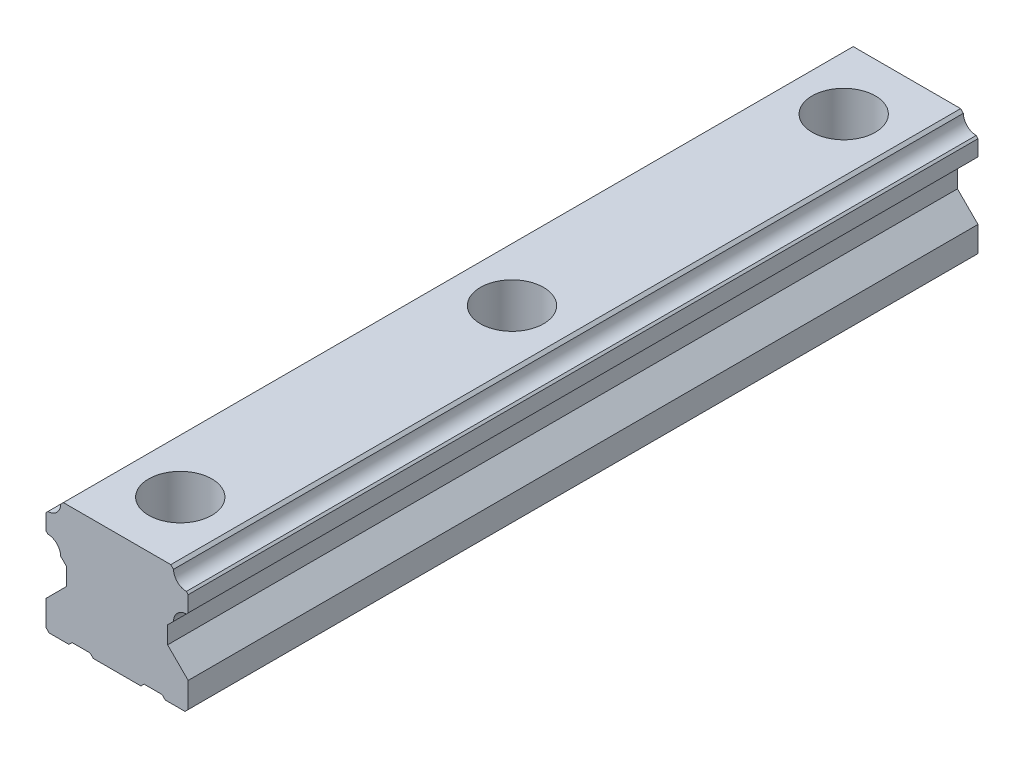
ISO-10303-21;
HEADER;
FILE_DESCRIPTION(('STEP AP214'),'2;1');
FILE_NAME('part.step','',(''),(''),'','','');
FILE_SCHEMA(('AUTOMOTIVE_DESIGN { 1 0 10303 214 1 1 1 1 }'));
ENDSEC;
DATA;
#1=APPLICATION_CONTEXT('core data for automotive mechanical design processes');
#2=APPLICATION_PROTOCOL_DEFINITION('international standard','automotive_design',2000,#1);
#3=PRODUCT_CONTEXT('',#1,'mechanical');
#4=PRODUCT('Part','Part','',(#3));
#5=PRODUCT_RELATED_PRODUCT_CATEGORY('part','',(#4));
#6=PRODUCT_DEFINITION_FORMATION('','',#4);
#7=PRODUCT_DEFINITION_CONTEXT('part definition',#1,'design');
#8=PRODUCT_DEFINITION('design','',#6,#7);
#9=PRODUCT_DEFINITION_SHAPE('','',#8);
#10=(LENGTH_UNIT() NAMED_UNIT(*) SI_UNIT(.MILLI.,.METRE.));
#11=(NAMED_UNIT(*) PLANE_ANGLE_UNIT() SI_UNIT($,.RADIAN.));
#12=(NAMED_UNIT(*) SI_UNIT($,.STERADIAN.) SOLID_ANGLE_UNIT());
#13=UNCERTAINTY_MEASURE_WITH_UNIT(LENGTH_MEASURE(1.E-05),#10,'distance_accuracy_value','');
#14=(GEOMETRIC_REPRESENTATION_CONTEXT(3) GLOBAL_UNCERTAINTY_ASSIGNED_CONTEXT((#13)) GLOBAL_UNIT_ASSIGNED_CONTEXT((#10,
#11,#12)) REPRESENTATION_CONTEXT('',''));
#15=CARTESIAN_POINT('',(0.,0.,0.));
#16=DIRECTION('',(0.,0.,1.));
#17=DIRECTION('',(1.,0.,0.));
#18=AXIS2_PLACEMENT_3D('',#15,#16,#17);
#19=CARTESIAN_POINT('',(-17.8608307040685,37.1391692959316,-250.));
#20=DIRECTION('',(0.707106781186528,-0.707106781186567,0.));
#21=DIRECTION('',(0.707106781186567,0.707106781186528,0.));
#22=AXIS2_PLACEMENT_3D('',#19,#20,#21);
#23=PLANE('',#22);
#24=DIRECTION('',(0.707106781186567,0.707106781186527,0.));
#25=VECTOR('',#24,1.);
#26=CARTESIAN_POINT('',(-17.8608307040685,37.1391692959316,0.));
#27=LINE('',#26,#25);
#28=CARTESIAN_POINT('',(-17.8608307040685,37.1391692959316,0.));
#29=VERTEX_POINT('',#28);
#30=CARTESIAN_POINT('',(-17.,38.,0.));
#31=VERTEX_POINT('',#30);
#32=EDGE_CURVE('E284',#29,#31,#27,.T.);
#33=ORIENTED_EDGE('',*,*,#32,.T.);
#34=DIRECTION('',(0.,0.,1.));
#35=VECTOR('',#34,1.);
#36=CARTESIAN_POINT('',(-17.,38.,-250.));
#37=LINE('',#36,#35);
#38=CARTESIAN_POINT('',(-17.,38.,-250.));
#39=VERTEX_POINT('',#38);
#40=EDGE_CURVE('E11',#39,#31,#37,.T.);
#41=ORIENTED_EDGE('',*,*,#40,.F.);
#42=DIRECTION('',(0.707106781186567,0.707106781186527,0.));
#43=VECTOR('',#42,1.);
#44=CARTESIAN_POINT('',(-17.8608307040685,37.1391692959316,-250.));
#45=LINE('',#44,#43);
#46=CARTESIAN_POINT('',(-17.8608307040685,37.1391692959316,-250.));
#47=VERTEX_POINT('',#46);
#48=EDGE_CURVE('E379',#47,#39,#45,.T.);
#49=ORIENTED_EDGE('',*,*,#48,.F.);
#50=DIRECTION('',(0.,0.,1.));
#51=VECTOR('',#50,1.);
#52=CARTESIAN_POINT('',(-17.8608307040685,37.1391692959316,-250.));
#53=LINE('',#52,#51);
#54=EDGE_CURVE('E280',#47,#29,#53,.T.);
#55=ORIENTED_EDGE('',*,*,#54,.T.);
#56=EDGE_LOOP('',(#33,#41,#49,#55));
#57=FACE_BOUND('',#56,.T.);
#58=ADVANCED_FACE('F39',(#57),#23,.F.);
#59=CARTESIAN_POINT('',(-17.,38.,-250.));
#60=DIRECTION('',(0.,-1.,0.));
#61=DIRECTION('',(0.,0.,-1.));
#62=AXIS2_PLACEMENT_3D('',#59,#60,#61);
#63=PLANE('',#62);
#64=CARTESIAN_POINT('',(0.,38.,-230.));
#65=DIRECTION('',(0.,1.,0.));
#66=DIRECTION('',(0.,0.,1.));
#67=AXIS2_PLACEMENT_3D('',#64,#65,#66);
#68=CIRCLE('',#67,10.);
#69=CARTESIAN_POINT('',(0.,38.,-220.));
#70=VERTEX_POINT('',#69);
#71=EDGE_CURVE('E860',#70,#70,#68,.T.);
#72=ORIENTED_EDGE('',*,*,#71,.F.);
#73=EDGE_LOOP('',(#72));
#74=FACE_BOUND('',#73,.T.);
#75=CARTESIAN_POINT('',(0.,38.,-125.));
#76=DIRECTION('',(0.,1.,0.));
#77=DIRECTION('',(0.,0.,1.));
#78=AXIS2_PLACEMENT_3D('',#75,#76,#77);
#79=CIRCLE('',#78,10.);
#80=CARTESIAN_POINT('',(0.,38.,-115.));
#81=VERTEX_POINT('',#80);
#82=EDGE_CURVE('E874',#81,#81,#79,.T.);
#83=ORIENTED_EDGE('',*,*,#82,.F.);
#84=EDGE_LOOP('',(#83));
#85=FACE_BOUND('',#84,.T.);
#86=CARTESIAN_POINT('',(0.,38.,-20.));
#87=DIRECTION('',(0.,1.,0.));
#88=DIRECTION('',(0.,0.,1.));
#89=AXIS2_PLACEMENT_3D('',#86,#87,#88);
#90=CIRCLE('',#89,10.);
#91=CARTESIAN_POINT('',(0.,38.,-10.));
#92=VERTEX_POINT('',#91);
#93=EDGE_CURVE('E890',#92,#92,#90,.T.);
#94=ORIENTED_EDGE('',*,*,#93,.F.);
#95=EDGE_LOOP('',(#94));
#96=FACE_BOUND('',#95,.T.);
#97=DIRECTION('',(1.,0.,0.));
#98=VECTOR('',#97,1.);
#99=CARTESIAN_POINT('',(-17.,38.,0.));
#100=LINE('',#99,#98);
#101=CARTESIAN_POINT('',(17.,38.,0.));
#102=VERTEX_POINT('',#101);
#103=EDGE_CURVE('E288',#31,#102,#100,.T.);
#104=ORIENTED_EDGE('',*,*,#103,.T.);
#105=DIRECTION('',(0.,0.,1.));
#106=VECTOR('',#105,1.);
#107=CARTESIAN_POINT('',(17.,38.,-250.));
#108=LINE('',#107,#106);
#109=CARTESIAN_POINT('',(17.,38.,-250.));
#110=VERTEX_POINT('',#109);
#111=EDGE_CURVE('E48',#110,#102,#108,.T.);
#112=ORIENTED_EDGE('',*,*,#111,.F.);
#113=DIRECTION('',(1.,0.,0.));
#114=VECTOR('',#113,1.);
#115=CARTESIAN_POINT('',(-17.,38.,-250.));
#116=LINE('',#115,#114);
#117=EDGE_CURVE('E171',#39,#110,#116,.T.);
#118=ORIENTED_EDGE('',*,*,#117,.F.);
#119=ORIENTED_EDGE('',*,*,#40,.T.);
#120=EDGE_LOOP('',(#104,#112,#118,#119));
#121=FACE_BOUND('',#120,.T.);
#122=ADVANCED_FACE('F613',(#74,#85,#96,#121),#63,.F.);
#123=CARTESIAN_POINT('',(17.,38.,-250.));
#124=DIRECTION('',(-0.707106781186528,-0.707106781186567,0.));
#125=DIRECTION('',(0.707106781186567,-0.707106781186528,0.));
#126=AXIS2_PLACEMENT_3D('',#123,#124,#125);
#127=PLANE('',#126);
#128=DIRECTION('',(0.707106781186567,-0.707106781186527,0.));
#129=VECTOR('',#128,1.);
#130=CARTESIAN_POINT('',(17.,38.,0.));
#131=LINE('',#130,#129);
#132=CARTESIAN_POINT('',(17.8608307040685,37.1391692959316,0.));
#133=VERTEX_POINT('',#132);
#134=EDGE_CURVE('E292',#102,#133,#131,.T.);
#135=ORIENTED_EDGE('',*,*,#134,.T.);
#136=DIRECTION('',(0.,0.,1.));
#137=VECTOR('',#136,1.);
#138=CARTESIAN_POINT('',(17.8608307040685,37.1391692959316,-250.));
#139=LINE('',#138,#137);
#140=CARTESIAN_POINT('',(17.8608307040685,37.1391692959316,-250.));
#141=VERTEX_POINT('',#140);
#142=EDGE_CURVE('E486',#141,#133,#139,.T.);
#143=ORIENTED_EDGE('',*,*,#142,.F.);
#144=DIRECTION('',(0.707106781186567,-0.707106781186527,0.));
#145=VECTOR('',#144,1.);
#146=CARTESIAN_POINT('',(17.,38.,-250.));
#147=LINE('',#146,#145);
#148=EDGE_CURVE('E496',#110,#141,#147,.T.);
#149=ORIENTED_EDGE('',*,*,#148,.F.);
#150=ORIENTED_EDGE('',*,*,#111,.T.);
#151=EDGE_LOOP('',(#135,#143,#149,#150));
#152=FACE_BOUND('',#151,.T.);
#153=ADVANCED_FACE('F494',(#152),#127,.F.);
#154=CARTESIAN_POINT('',(21.99,37.222,-250.));
#155=DIRECTION('',(0.,0.,1.));
#156=DIRECTION('',(1.,0.,0.));
#157=AXIS2_PLACEMENT_3D('',#154,#155,#156);
#158=CYLINDRICAL_SURFACE('',#157,4.12999999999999);
#159=CARTESIAN_POINT('',(21.99,37.222,0.));
#160=DIRECTION('',(0.,0.,1.));
#161=DIRECTION('',(1.,0.,0.));
#162=AXIS2_PLACEMENT_3D('',#159,#160,#161);
#163=CIRCLE('',#162,4.12999999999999);
#164=CARTESIAN_POINT('',(21.9071692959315,33.0928307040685,0.));
#165=VERTEX_POINT('',#164);
#166=EDGE_CURVE('E295',#133,#165,#163,.T.);
#167=ORIENTED_EDGE('',*,*,#166,.T.);
#168=DIRECTION('',(0.,0.,1.));
#169=VECTOR('',#168,1.);
#170=CARTESIAN_POINT('',(21.9071692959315,33.0928307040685,-250.));
#171=LINE('',#170,#169);
#172=CARTESIAN_POINT('',(21.9071692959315,33.0928307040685,-250.));
#173=VERTEX_POINT('',#172);
#174=EDGE_CURVE('E482',#173,#165,#171,.T.);
#175=ORIENTED_EDGE('',*,*,#174,.F.);
#176=CARTESIAN_POINT('',(21.99,37.222,-250.));
#177=DIRECTION('',(0.,0.,1.));
#178=DIRECTION('',(1.,0.,0.));
#179=AXIS2_PLACEMENT_3D('',#176,#177,#178);
#180=CIRCLE('',#179,4.12999999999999);
#181=EDGE_CURVE('E515',#141,#173,#180,.T.);
#182=ORIENTED_EDGE('',*,*,#181,.F.);
#183=ORIENTED_EDGE('',*,*,#142,.T.);
#184=EDGE_LOOP('',(#167,#175,#182,#183));
#185=FACE_BOUND('',#184,.T.);
#186=ADVANCED_FACE('F505',(#185),#158,.F.);
#187=CARTESIAN_POINT('',(21.9071692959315,33.0928307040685,-250.));
#188=DIRECTION('',(-0.707106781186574,-0.707106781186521,0.));
#189=DIRECTION('',(0.707106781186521,-0.707106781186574,0.));
#190=AXIS2_PLACEMENT_3D('',#187,#188,#189);
#191=PLANE('',#190);
#192=DIRECTION('',(0.707106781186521,-0.707106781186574,0.));
#193=VECTOR('',#192,1.);
#194=CARTESIAN_POINT('',(21.9071692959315,33.0928307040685,0.));
#195=LINE('',#194,#193);
#196=CARTESIAN_POINT('',(22.5,32.5,0.));
#197=VERTEX_POINT('',#196);
#198=EDGE_CURVE('E298',#165,#197,#195,.T.);
#199=ORIENTED_EDGE('',*,*,#198,.T.);
#200=DIRECTION('',(0.,0.,1.));
#201=VECTOR('',#200,1.);
#202=CARTESIAN_POINT('',(22.5,32.5,-250.));
#203=LINE('',#202,#201);
#204=CARTESIAN_POINT('',(22.5,32.5,-250.));
#205=VERTEX_POINT('',#204);
#206=EDGE_CURVE('E478',#205,#197,#203,.T.);
#207=ORIENTED_EDGE('',*,*,#206,.F.);
#208=DIRECTION('',(0.707106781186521,-0.707106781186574,0.));
#209=VECTOR('',#208,1.);
#210=CARTESIAN_POINT('',(21.9071692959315,33.0928307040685,-250.));
#211=LINE('',#210,#209);
#212=EDGE_CURVE('E511',#173,#205,#211,.T.);
#213=ORIENTED_EDGE('',*,*,#212,.F.);
#214=ORIENTED_EDGE('',*,*,#174,.T.);
#215=EDGE_LOOP('',(#199,#207,#213,#214));
#216=FACE_BOUND('',#215,.T.);
#217=ADVANCED_FACE('F509',(#216),#191,.F.);
#218=CARTESIAN_POINT('',(22.5,32.5,-250.));
#219=DIRECTION('',(-1.,0.,0.));
#220=DIRECTION('',(0.,0.,1.));
#221=AXIS2_PLACEMENT_3D('',#218,#219,#220);
#222=PLANE('',#221);
#223=DIRECTION('',(0.,-1.,0.));
#224=VECTOR('',#223,1.);
#225=CARTESIAN_POINT('',(22.5,32.5,0.));
#226=LINE('',#225,#224);
#227=CARTESIAN_POINT('',(22.5,27.5,0.));
#228=VERTEX_POINT('',#227);
#229=EDGE_CURVE('E301',#197,#228,#226,.T.);
#230=ORIENTED_EDGE('',*,*,#229,.T.);
#231=DIRECTION('',(0.,0.,1.));
#232=VECTOR('',#231,1.);
#233=CARTESIAN_POINT('',(22.5,27.5,-250.));
#234=LINE('',#233,#232);
#235=CARTESIAN_POINT('',(22.5,27.5,-250.));
#236=VERTEX_POINT('',#235);
#237=EDGE_CURVE('E474',#236,#228,#234,.T.);
#238=ORIENTED_EDGE('',*,*,#237,.F.);
#239=DIRECTION('',(0.,-1.,0.));
#240=VECTOR('',#239,1.);
#241=CARTESIAN_POINT('',(22.5,32.5,-250.));
#242=LINE('',#241,#240);
#243=EDGE_CURVE('E514',#205,#236,#242,.T.);
#244=ORIENTED_EDGE('',*,*,#243,.F.);
#245=ORIENTED_EDGE('',*,*,#206,.T.);
#246=EDGE_LOOP('',(#230,#238,#244,#245));
#247=FACE_BOUND('',#246,.T.);
#248=ADVANCED_FACE('F629',(#247),#222,.F.);
#249=CARTESIAN_POINT('',(22.5,27.5,-250.));
#250=DIRECTION('',(-0.707106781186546,0.70710678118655,0.));
#251=DIRECTION('',(-0.70710678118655,-0.707106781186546,0.));
#252=AXIS2_PLACEMENT_3D('',#249,#250,#251);
#253=PLANE('',#252);
#254=DIRECTION('',(-0.70710678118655,-0.707106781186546,0.));
#255=VECTOR('',#254,1.);
#256=CARTESIAN_POINT('',(22.5,27.5,0.));
#257=LINE('',#256,#255);
#258=CARTESIAN_POINT('',(21.9092097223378,26.9092097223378,0.));
#259=VERTEX_POINT('',#258);
#260=EDGE_CURVE('E304',#228,#259,#257,.T.);
#261=ORIENTED_EDGE('',*,*,#260,.T.);
#262=DIRECTION('',(0.,0.,1.));
#263=VECTOR('',#262,1.);
#264=CARTESIAN_POINT('',(21.9092097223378,26.9092097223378,-250.));
#265=LINE('',#264,#263);
#266=CARTESIAN_POINT('',(21.9092097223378,26.9092097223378,-250.));
#267=VERTEX_POINT('',#266);
#268=EDGE_CURVE('E470',#267,#259,#265,.T.);
#269=ORIENTED_EDGE('',*,*,#268,.F.);
#270=DIRECTION('',(-0.70710678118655,-0.707106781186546,0.));
#271=VECTOR('',#270,1.);
#272=CARTESIAN_POINT('',(22.5,27.5,-250.));
#273=LINE('',#272,#271);
#274=EDGE_CURVE('E519',#236,#267,#273,.T.);
#275=ORIENTED_EDGE('',*,*,#274,.F.);
#276=ORIENTED_EDGE('',*,*,#237,.T.);
#277=EDGE_LOOP('',(#261,#269,#275,#276));
#278=FACE_BOUND('',#277,.T.);
#279=ADVANCED_FACE('F632',(#278),#253,.F.);
#280=CARTESIAN_POINT('',(21.9899999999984,22.7800000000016,-250.));
#281=DIRECTION('',(0.,0.,1.));
#282=DIRECTION('',(1.,0.,0.));
#283=AXIS2_PLACEMENT_3D('',#280,#281,#282);
#284=CYLINDRICAL_SURFACE('',#283,4.13);
#285=CARTESIAN_POINT('',(21.9899999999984,22.7800000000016,0.));
#286=DIRECTION('',(0.,0.,1.));
#287=DIRECTION('',(1.,0.,0.));
#288=AXIS2_PLACEMENT_3D('',#285,#286,#287);
#289=CIRCLE('',#288,4.13);
#290=CARTESIAN_POINT('',(17.8607902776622,22.8607902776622,0.));
#291=VERTEX_POINT('',#290);
#292=EDGE_CURVE('E307',#259,#291,#289,.T.);
#293=ORIENTED_EDGE('',*,*,#292,.T.);
#294=DIRECTION('',(0.,0.,1.));
#295=VECTOR('',#294,1.);
#296=CARTESIAN_POINT('',(17.8607902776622,22.8607902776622,-250.));
#297=LINE('',#296,#295);
#298=CARTESIAN_POINT('',(17.8607902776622,22.8607902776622,-250.));
#299=VERTEX_POINT('',#298);
#300=EDGE_CURVE('E466',#299,#291,#297,.T.);
#301=ORIENTED_EDGE('',*,*,#300,.F.);
#302=CARTESIAN_POINT('',(21.9899999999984,22.7800000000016,-250.));
#303=DIRECTION('',(0.,0.,1.));
#304=DIRECTION('',(1.,0.,0.));
#305=AXIS2_PLACEMENT_3D('',#302,#303,#304);
#306=CIRCLE('',#305,4.13);
#307=EDGE_CURVE('E526',#267,#299,#306,.T.);
#308=ORIENTED_EDGE('',*,*,#307,.F.);
#309=ORIENTED_EDGE('',*,*,#268,.T.);
#310=EDGE_LOOP('',(#293,#301,#308,#309));
#311=FACE_BOUND('',#310,.T.);
#312=ADVANCED_FACE('F636',(#311),#284,.F.);
#313=CARTESIAN_POINT('',(17.8607902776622,22.8607902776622,-250.));
#314=DIRECTION('',(-0.707106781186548,0.707106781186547,0.));
#315=DIRECTION('',(-0.707106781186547,-0.707106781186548,0.));
#316=AXIS2_PLACEMENT_3D('',#313,#314,#315);
#317=PLANE('',#316);
#318=DIRECTION('',(-0.707106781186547,-0.707106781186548,0.));
#319=VECTOR('',#318,1.);
#320=CARTESIAN_POINT('',(17.8607902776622,22.8607902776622,0.));
#321=LINE('',#320,#319);
#322=CARTESIAN_POINT('',(16.,21.,0.));
#323=VERTEX_POINT('',#322);
#324=EDGE_CURVE('E310',#291,#323,#321,.T.);
#325=ORIENTED_EDGE('',*,*,#324,.T.);
#326=DIRECTION('',(0.,0.,1.));
#327=VECTOR('',#326,1.);
#328=CARTESIAN_POINT('',(16.,21.,-250.));
#329=LINE('',#328,#327);
#330=CARTESIAN_POINT('',(16.,21.,-250.));
#331=VERTEX_POINT('',#330);
#332=EDGE_CURVE('E462',#331,#323,#329,.T.);
#333=ORIENTED_EDGE('',*,*,#332,.F.);
#334=DIRECTION('',(-0.707106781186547,-0.707106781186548,0.));
#335=VECTOR('',#334,1.);
#336=CARTESIAN_POINT('',(17.8607902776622,22.8607902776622,-250.));
#337=LINE('',#336,#335);
#338=EDGE_CURVE('E529',#299,#331,#337,.T.);
#339=ORIENTED_EDGE('',*,*,#338,.F.);
#340=ORIENTED_EDGE('',*,*,#300,.T.);
#341=EDGE_LOOP('',(#325,#333,#339,#340));
#342=FACE_BOUND('',#341,.T.);
#343=ADVANCED_FACE('F640',(#342),#317,.F.);
#344=CARTESIAN_POINT('',(16.,21.,-250.));
#345=DIRECTION('',(-1.,0.,0.));
#346=DIRECTION('',(0.,0.,1.));
#347=AXIS2_PLACEMENT_3D('',#344,#345,#346);
#348=PLANE('',#347);
#349=DIRECTION('',(0.,-1.,0.));
#350=VECTOR('',#349,1.);
#351=CARTESIAN_POINT('',(16.,21.,0.));
#352=LINE('',#351,#350);
#353=CARTESIAN_POINT('',(16.,15.5,0.));
#354=VERTEX_POINT('',#353);
#355=EDGE_CURVE('E313',#323,#354,#352,.T.);
#356=ORIENTED_EDGE('',*,*,#355,.T.);
#357=DIRECTION('',(0.,0.,1.));
#358=VECTOR('',#357,1.);
#359=CARTESIAN_POINT('',(16.,15.5,-250.));
#360=LINE('',#359,#358);
#361=CARTESIAN_POINT('',(16.,15.5,-250.));
#362=VERTEX_POINT('',#361);
#363=EDGE_CURVE('E458',#362,#354,#360,.T.);
#364=ORIENTED_EDGE('',*,*,#363,.F.);
#365=DIRECTION('',(0.,-1.,0.));
#366=VECTOR('',#365,1.);
#367=CARTESIAN_POINT('',(16.,21.,-250.));
#368=LINE('',#367,#366);
#369=EDGE_CURVE('E532',#331,#362,#368,.T.);
#370=ORIENTED_EDGE('',*,*,#369,.F.);
#371=ORIENTED_EDGE('',*,*,#332,.T.);
#372=EDGE_LOOP('',(#356,#364,#370,#371));
#373=FACE_BOUND('',#372,.T.);
#374=ADVANCED_FACE('F644',(#373),#348,.F.);
#375=CARTESIAN_POINT('',(16.,15.5,-250.));
#376=DIRECTION('',(-0.707106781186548,-0.707106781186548,0.));
#377=DIRECTION('',(0.707106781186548,-0.707106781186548,0.));
#378=AXIS2_PLACEMENT_3D('',#375,#376,#377);
#379=PLANE('',#378);
#380=DIRECTION('',(0.707106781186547,-0.707106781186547,0.));
#381=VECTOR('',#380,1.);
#382=CARTESIAN_POINT('',(16.,15.5,0.));
#383=LINE('',#382,#381);
#384=CARTESIAN_POINT('',(22.5,9.,0.));
#385=VERTEX_POINT('',#384);
#386=EDGE_CURVE('E316',#354,#385,#383,.T.);
#387=ORIENTED_EDGE('',*,*,#386,.T.);
#388=DIRECTION('',(0.,0.,1.));
#389=VECTOR('',#388,1.);
#390=CARTESIAN_POINT('',(22.5,9.,-250.));
#391=LINE('',#390,#389);
#392=CARTESIAN_POINT('',(22.5,9.,-250.));
#393=VERTEX_POINT('',#392);
#394=EDGE_CURVE('E454',#393,#385,#391,.T.);
#395=ORIENTED_EDGE('',*,*,#394,.F.);
#396=DIRECTION('',(0.707106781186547,-0.707106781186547,0.));
#397=VECTOR('',#396,1.);
#398=CARTESIAN_POINT('',(16.,15.5,-250.));
#399=LINE('',#398,#397);
#400=EDGE_CURVE('E535',#362,#393,#399,.T.);
#401=ORIENTED_EDGE('',*,*,#400,.F.);
#402=ORIENTED_EDGE('',*,*,#363,.T.);
#403=EDGE_LOOP('',(#387,#395,#401,#402));
#404=FACE_BOUND('',#403,.T.);
#405=ADVANCED_FACE('F648',(#404),#379,.F.);
#406=CARTESIAN_POINT('',(22.5,9.,-250.));
#407=DIRECTION('',(-1.,0.,0.));
#408=DIRECTION('',(0.,0.,1.));
#409=AXIS2_PLACEMENT_3D('',#406,#407,#408);
#410=PLANE('',#409);
#411=DIRECTION('',(0.,-1.,0.));
#412=VECTOR('',#411,1.);
#413=CARTESIAN_POINT('',(22.5,9.,0.));
#414=LINE('',#413,#412);
#415=CARTESIAN_POINT('',(22.5,1.,0.));
#416=VERTEX_POINT('',#415);
#417=EDGE_CURVE('E319',#385,#416,#414,.T.);
#418=ORIENTED_EDGE('',*,*,#417,.T.);
#419=DIRECTION('',(0.,0.,1.));
#420=VECTOR('',#419,1.);
#421=CARTESIAN_POINT('',(22.5,1.,-250.));
#422=LINE('',#421,#420);
#423=CARTESIAN_POINT('',(22.5,1.,-250.));
#424=VERTEX_POINT('',#423);
#425=EDGE_CURVE('E450',#424,#416,#422,.T.);
#426=ORIENTED_EDGE('',*,*,#425,.F.);
#427=DIRECTION('',(0.,-1.,0.));
#428=VECTOR('',#427,1.);
#429=CARTESIAN_POINT('',(22.5,9.,-250.));
#430=LINE('',#429,#428);
#431=EDGE_CURVE('E538',#393,#424,#430,.T.);
#432=ORIENTED_EDGE('',*,*,#431,.F.);
#433=ORIENTED_EDGE('',*,*,#394,.T.);
#434=EDGE_LOOP('',(#418,#426,#432,#433));
#435=FACE_BOUND('',#434,.T.);
#436=ADVANCED_FACE('F652',(#435),#410,.F.);
#437=CARTESIAN_POINT('',(22.5,1.,-250.));
#438=DIRECTION('',(-0.707106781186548,0.707106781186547,0.));
#439=DIRECTION('',(-0.707106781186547,-0.707106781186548,0.));
#440=AXIS2_PLACEMENT_3D('',#437,#438,#439);
#441=PLANE('',#440);
#442=DIRECTION('',(-0.707106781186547,-0.707106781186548,0.));
#443=VECTOR('',#442,1.);
#444=CARTESIAN_POINT('',(22.5,1.,0.));
#445=LINE('',#444,#443);
#446=CARTESIAN_POINT('',(21.5,0.,0.));
#447=VERTEX_POINT('',#446);
#448=EDGE_CURVE('E322',#416,#447,#445,.T.);
#449=ORIENTED_EDGE('',*,*,#448,.T.);
#450=DIRECTION('',(0.,0.,1.));
#451=VECTOR('',#450,1.);
#452=CARTESIAN_POINT('',(21.5,0.,-250.));
#453=LINE('',#452,#451);
#454=CARTESIAN_POINT('',(21.5,0.,-250.));
#455=VERTEX_POINT('',#454);
#456=EDGE_CURVE('E446',#455,#447,#453,.T.);
#457=ORIENTED_EDGE('',*,*,#456,.F.);
#458=DIRECTION('',(-0.707106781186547,-0.707106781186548,0.));
#459=VECTOR('',#458,1.);
#460=CARTESIAN_POINT('',(22.5,1.,-250.));
#461=LINE('',#460,#459);
#462=EDGE_CURVE('E541',#424,#455,#461,.T.);
#463=ORIENTED_EDGE('',*,*,#462,.F.);
#464=ORIENTED_EDGE('',*,*,#425,.T.);
#465=EDGE_LOOP('',(#449,#457,#463,#464));
#466=FACE_BOUND('',#465,.T.);
#467=ADVANCED_FACE('F656',(#466),#441,.F.);
#468=CARTESIAN_POINT('',(21.5,0.,-250.));
#469=DIRECTION('',(0.,1.,0.));
#470=DIRECTION('',(0.,0.,1.));
#471=AXIS2_PLACEMENT_3D('',#468,#469,#470);
#472=PLANE('',#471);
#473=DIRECTION('',(-1.,0.,0.));
#474=VECTOR('',#473,1.);
#475=CARTESIAN_POINT('',(21.5,0.,0.));
#476=LINE('',#475,#474);
#477=CARTESIAN_POINT('',(15.25,0.,0.));
#478=VERTEX_POINT('',#477);
#479=EDGE_CURVE('E325',#447,#478,#476,.T.);
#480=ORIENTED_EDGE('',*,*,#479,.T.);
#481=DIRECTION('',(0.,0.,1.));
#482=VECTOR('',#481,1.);
#483=CARTESIAN_POINT('',(15.25,0.,-250.));
#484=LINE('',#483,#482);
#485=CARTESIAN_POINT('',(15.25,0.,-250.));
#486=VERTEX_POINT('',#485);
#487=EDGE_CURVE('E442',#486,#478,#484,.T.);
#488=ORIENTED_EDGE('',*,*,#487,.F.);
#489=DIRECTION('',(-1.,0.,0.));
#490=VECTOR('',#489,1.);
#491=CARTESIAN_POINT('',(21.5,0.,-250.));
#492=LINE('',#491,#490);
#493=EDGE_CURVE('E544',#455,#486,#492,.T.);
#494=ORIENTED_EDGE('',*,*,#493,.F.);
#495=ORIENTED_EDGE('',*,*,#456,.T.);
#496=EDGE_LOOP('',(#480,#488,#494,#495));
#497=FACE_BOUND('',#496,.T.);
#498=ADVANCED_FACE('F660',(#497),#472,.F.);
#499=CARTESIAN_POINT('',(15.25,0.,-250.));
#500=DIRECTION('',(0.707106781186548,0.707106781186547,0.));
#501=DIRECTION('',(-0.707106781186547,0.707106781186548,0.));
#502=AXIS2_PLACEMENT_3D('',#499,#500,#501);
#503=PLANE('',#502);
#504=DIRECTION('',(-0.707106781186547,0.707106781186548,0.));
#505=VECTOR('',#504,1.);
#506=CARTESIAN_POINT('',(15.25,0.,0.));
#507=LINE('',#506,#505);
#508=CARTESIAN_POINT('',(14.25,1.,0.));
#509=VERTEX_POINT('',#508);
#510=EDGE_CURVE('E328',#478,#509,#507,.T.);
#511=ORIENTED_EDGE('',*,*,#510,.T.);
#512=DIRECTION('',(0.,0.,1.));
#513=VECTOR('',#512,1.);
#514=CARTESIAN_POINT('',(14.25,1.,-250.));
#515=LINE('',#514,#513);
#516=CARTESIAN_POINT('',(14.25,1.,-250.));
#517=VERTEX_POINT('',#516);
#518=EDGE_CURVE('E438',#517,#509,#515,.T.);
#519=ORIENTED_EDGE('',*,*,#518,.F.);
#520=DIRECTION('',(-0.707106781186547,0.707106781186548,0.));
#521=VECTOR('',#520,1.);
#522=CARTESIAN_POINT('',(15.25,0.,-250.));
#523=LINE('',#522,#521);
#524=EDGE_CURVE('E547',#486,#517,#523,.T.);
#525=ORIENTED_EDGE('',*,*,#524,.F.);
#526=ORIENTED_EDGE('',*,*,#487,.T.);
#527=EDGE_LOOP('',(#511,#519,#525,#526));
#528=FACE_BOUND('',#527,.T.);
#529=ADVANCED_FACE('F664',(#528),#503,.F.);
#530=CARTESIAN_POINT('',(14.25,1.,-250.));
#531=DIRECTION('',(0.,1.,0.));
#532=DIRECTION('',(0.,0.,1.));
#533=AXIS2_PLACEMENT_3D('',#530,#531,#532);
#534=PLANE('',#533);
#535=DIRECTION('',(-1.,0.,0.));
#536=VECTOR('',#535,1.);
#537=CARTESIAN_POINT('',(14.25,1.,0.));
#538=LINE('',#537,#536);
#539=CARTESIAN_POINT('',(8.55,1.,0.));
#540=VERTEX_POINT('',#539);
#541=EDGE_CURVE('E331',#509,#540,#538,.T.);
#542=ORIENTED_EDGE('',*,*,#541,.T.);
#543=DIRECTION('',(0.,0.,1.));
#544=VECTOR('',#543,1.);
#545=CARTESIAN_POINT('',(8.55,1.,-250.));
#546=LINE('',#545,#544);
#547=CARTESIAN_POINT('',(8.55,1.,-250.));
#548=VERTEX_POINT('',#547);
#549=EDGE_CURVE('E434',#548,#540,#546,.T.);
#550=ORIENTED_EDGE('',*,*,#549,.F.);
#551=DIRECTION('',(-1.,0.,0.));
#552=VECTOR('',#551,1.);
#553=CARTESIAN_POINT('',(14.25,1.,-250.));
#554=LINE('',#553,#552);
#555=EDGE_CURVE('E550',#517,#548,#554,.T.);
#556=ORIENTED_EDGE('',*,*,#555,.F.);
#557=ORIENTED_EDGE('',*,*,#518,.T.);
#558=EDGE_LOOP('',(#542,#550,#556,#557));
#559=FACE_BOUND('',#558,.T.);
#560=ADVANCED_FACE('F668',(#559),#534,.F.);
#561=CARTESIAN_POINT('',(8.55,1.,-250.));
#562=DIRECTION('',(-0.707106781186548,0.707106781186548,0.));
#563=DIRECTION('',(-0.707106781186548,-0.707106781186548,0.));
#564=AXIS2_PLACEMENT_3D('',#561,#562,#563);
#565=PLANE('',#564);
#566=DIRECTION('',(-0.707106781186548,-0.707106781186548,0.));
#567=VECTOR('',#566,1.);
#568=CARTESIAN_POINT('',(8.55,1.,0.));
#569=LINE('',#568,#567);
#570=CARTESIAN_POINT('',(7.55,0.,0.));
#571=VERTEX_POINT('',#570);
#572=EDGE_CURVE('E334',#540,#571,#569,.T.);
#573=ORIENTED_EDGE('',*,*,#572,.T.);
#574=DIRECTION('',(0.,0.,1.));
#575=VECTOR('',#574,1.);
#576=CARTESIAN_POINT('',(7.55,0.,-250.));
#577=LINE('',#576,#575);
#578=CARTESIAN_POINT('',(7.55,0.,-250.));
#579=VERTEX_POINT('',#578);
#580=EDGE_CURVE('E430',#579,#571,#577,.T.);
#581=ORIENTED_EDGE('',*,*,#580,.F.);
#582=DIRECTION('',(-0.707106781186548,-0.707106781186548,0.));
#583=VECTOR('',#582,1.);
#584=CARTESIAN_POINT('',(8.55,1.,-250.));
#585=LINE('',#584,#583);
#586=EDGE_CURVE('E553',#548,#579,#585,.T.);
#587=ORIENTED_EDGE('',*,*,#586,.F.);
#588=ORIENTED_EDGE('',*,*,#549,.T.);
#589=EDGE_LOOP('',(#573,#581,#587,#588));
#590=FACE_BOUND('',#589,.T.);
#591=ADVANCED_FACE('F672',(#590),#565,.F.);
#592=CARTESIAN_POINT('',(7.55,0.,-250.));
#593=DIRECTION('',(0.,1.,0.));
#594=DIRECTION('',(0.,0.,1.));
#595=AXIS2_PLACEMENT_3D('',#592,#593,#594);
#596=PLANE('',#595);
#597=CARTESIAN_POINT('',(0.,0.,-230.));
#598=DIRECTION('',(0.,1.,0.));
#599=DIRECTION('',(0.,0.,1.));
#600=AXIS2_PLACEMENT_3D('',#597,#598,#599);
#601=CIRCLE('',#600,6.99999999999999);
#602=CARTESIAN_POINT('',(0.,0.,-223.));
#603=VERTEX_POINT('',#602);
#604=EDGE_CURVE('E870',#603,#603,#601,.T.);
#605=ORIENTED_EDGE('',*,*,#604,.T.);
#606=EDGE_LOOP('',(#605));
#607=FACE_BOUND('',#606,.T.);
#608=CARTESIAN_POINT('',(0.,0.,-125.));
#609=DIRECTION('',(0.,1.,0.));
#610=DIRECTION('',(0.,0.,1.));
#611=AXIS2_PLACEMENT_3D('',#608,#609,#610);
#612=CIRCLE('',#611,6.99999999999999);
#613=CARTESIAN_POINT('',(0.,0.,-118.));
#614=VERTEX_POINT('',#613);
#615=EDGE_CURVE('E886',#614,#614,#612,.T.);
#616=ORIENTED_EDGE('',*,*,#615,.T.);
#617=EDGE_LOOP('',(#616));
#618=FACE_BOUND('',#617,.T.);
#619=CARTESIAN_POINT('',(0.,0.,-20.));
#620=DIRECTION('',(0.,1.,0.));
#621=DIRECTION('',(0.,0.,1.));
#622=AXIS2_PLACEMENT_3D('',#619,#620,#621);
#623=CIRCLE('',#622,6.99999999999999);
#624=CARTESIAN_POINT('',(0.,0.,-13.));
#625=VERTEX_POINT('',#624);
#626=EDGE_CURVE('E289',#625,#625,#623,.T.);
#627=ORIENTED_EDGE('',*,*,#626,.T.);
#628=EDGE_LOOP('',(#627));
#629=FACE_BOUND('',#628,.T.);
#630=DIRECTION('',(-1.,0.,0.));
#631=VECTOR('',#630,1.);
#632=CARTESIAN_POINT('',(7.55,0.,0.));
#633=LINE('',#632,#631);
#634=CARTESIAN_POINT('',(-7.55,0.,0.));
#635=VERTEX_POINT('',#634);
#636=EDGE_CURVE('E337',#571,#635,#633,.T.);
#637=ORIENTED_EDGE('',*,*,#636,.T.);
#638=DIRECTION('',(0.,0.,1.));
#639=VECTOR('',#638,1.);
#640=CARTESIAN_POINT('',(-7.55,0.,-250.));
#641=LINE('',#640,#639);
#642=CARTESIAN_POINT('',(-7.55,0.,-250.));
#643=VERTEX_POINT('',#642);
#644=EDGE_CURVE('E426',#643,#635,#641,.T.);
#645=ORIENTED_EDGE('',*,*,#644,.F.);
#646=DIRECTION('',(-1.,0.,0.));
#647=VECTOR('',#646,1.);
#648=CARTESIAN_POINT('',(7.55,0.,-250.));
#649=LINE('',#648,#647);
#650=EDGE_CURVE('E556',#579,#643,#649,.T.);
#651=ORIENTED_EDGE('',*,*,#650,.F.);
#652=ORIENTED_EDGE('',*,*,#580,.T.);
#653=EDGE_LOOP('',(#637,#645,#651,#652));
#654=FACE_BOUND('',#653,.T.);
#655=ADVANCED_FACE('F676',(#607,#618,#629,#654),#596,.F.);
#656=CARTESIAN_POINT('',(-7.55,0.,-250.));
#657=DIRECTION('',(0.707106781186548,0.707106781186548,0.));
#658=DIRECTION('',(-0.707106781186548,0.707106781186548,0.));
#659=AXIS2_PLACEMENT_3D('',#656,#657,#658);
#660=PLANE('',#659);
#661=DIRECTION('',(-0.707106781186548,0.707106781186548,0.));
#662=VECTOR('',#661,1.);
#663=CARTESIAN_POINT('',(-7.55,0.,0.));
#664=LINE('',#663,#662);
#665=CARTESIAN_POINT('',(-8.55,1.,0.));
#666=VERTEX_POINT('',#665);
#667=EDGE_CURVE('E340',#635,#666,#664,.T.);
#668=ORIENTED_EDGE('',*,*,#667,.T.);
#669=DIRECTION('',(0.,0.,1.));
#670=VECTOR('',#669,1.);
#671=CARTESIAN_POINT('',(-8.55,1.,-250.));
#672=LINE('',#671,#670);
#673=CARTESIAN_POINT('',(-8.55,1.,-250.));
#674=VERTEX_POINT('',#673);
#675=EDGE_CURVE('E422',#674,#666,#672,.T.);
#676=ORIENTED_EDGE('',*,*,#675,.F.);
#677=DIRECTION('',(-0.707106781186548,0.707106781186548,0.));
#678=VECTOR('',#677,1.);
#679=CARTESIAN_POINT('',(-7.55,0.,-250.));
#680=LINE('',#679,#678);
#681=EDGE_CURVE('E559',#643,#674,#680,.T.);
#682=ORIENTED_EDGE('',*,*,#681,.F.);
#683=ORIENTED_EDGE('',*,*,#644,.T.);
#684=EDGE_LOOP('',(#668,#676,#682,#683));
#685=FACE_BOUND('',#684,.T.);
#686=ADVANCED_FACE('F680',(#685),#660,.F.);
#687=CARTESIAN_POINT('',(-8.55,1.,-250.));
#688=DIRECTION('',(0.,1.,0.));
#689=DIRECTION('',(0.,0.,1.));
#690=AXIS2_PLACEMENT_3D('',#687,#688,#689);
#691=PLANE('',#690);
#692=DIRECTION('',(-1.,0.,0.));
#693=VECTOR('',#692,1.);
#694=CARTESIAN_POINT('',(-8.55,1.,0.));
#695=LINE('',#694,#693);
#696=CARTESIAN_POINT('',(-14.25,1.,0.));
#697=VERTEX_POINT('',#696);
#698=EDGE_CURVE('E343',#666,#697,#695,.T.);
#699=ORIENTED_EDGE('',*,*,#698,.T.);
#700=DIRECTION('',(0.,0.,1.));
#701=VECTOR('',#700,1.);
#702=CARTESIAN_POINT('',(-14.25,1.,-250.));
#703=LINE('',#702,#701);
#704=CARTESIAN_POINT('',(-14.25,1.,-250.));
#705=VERTEX_POINT('',#704);
#706=EDGE_CURVE('E418',#705,#697,#703,.T.);
#707=ORIENTED_EDGE('',*,*,#706,.F.);
#708=DIRECTION('',(-1.,0.,0.));
#709=VECTOR('',#708,1.);
#710=CARTESIAN_POINT('',(-8.55,1.,-250.));
#711=LINE('',#710,#709);
#712=EDGE_CURVE('E562',#674,#705,#711,.T.);
#713=ORIENTED_EDGE('',*,*,#712,.F.);
#714=ORIENTED_EDGE('',*,*,#675,.T.);
#715=EDGE_LOOP('',(#699,#707,#713,#714));
#716=FACE_BOUND('',#715,.T.);
#717=ADVANCED_FACE('F684',(#716),#691,.F.);
#718=CARTESIAN_POINT('',(-14.25,1.,-250.));
#719=DIRECTION('',(-0.707106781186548,0.707106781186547,0.));
#720=DIRECTION('',(-0.707106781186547,-0.707106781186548,0.));
#721=AXIS2_PLACEMENT_3D('',#718,#719,#720);
#722=PLANE('',#721);
#723=DIRECTION('',(-0.707106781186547,-0.707106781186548,0.));
#724=VECTOR('',#723,1.);
#725=CARTESIAN_POINT('',(-14.25,1.,0.));
#726=LINE('',#725,#724);
#727=CARTESIAN_POINT('',(-15.25,0.,0.));
#728=VERTEX_POINT('',#727);
#729=EDGE_CURVE('E346',#697,#728,#726,.T.);
#730=ORIENTED_EDGE('',*,*,#729,.T.);
#731=DIRECTION('',(0.,0.,1.));
#732=VECTOR('',#731,1.);
#733=CARTESIAN_POINT('',(-15.25,0.,-250.));
#734=LINE('',#733,#732);
#735=CARTESIAN_POINT('',(-15.25,0.,-250.));
#736=VERTEX_POINT('',#735);
#737=EDGE_CURVE('E414',#736,#728,#734,.T.);
#738=ORIENTED_EDGE('',*,*,#737,.F.);
#739=DIRECTION('',(-0.707106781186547,-0.707106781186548,0.));
#740=VECTOR('',#739,1.);
#741=CARTESIAN_POINT('',(-14.25,1.,-250.));
#742=LINE('',#741,#740);
#743=EDGE_CURVE('E565',#705,#736,#742,.T.);
#744=ORIENTED_EDGE('',*,*,#743,.F.);
#745=ORIENTED_EDGE('',*,*,#706,.T.);
#746=EDGE_LOOP('',(#730,#738,#744,#745));
#747=FACE_BOUND('',#746,.T.);
#748=ADVANCED_FACE('F688',(#747),#722,.F.);
#749=CARTESIAN_POINT('',(-15.25,0.,-250.));
#750=DIRECTION('',(0.,1.,0.));
#751=DIRECTION('',(0.,0.,1.));
#752=AXIS2_PLACEMENT_3D('',#749,#750,#751);
#753=PLANE('',#752);
#754=DIRECTION('',(-1.,0.,0.));
#755=VECTOR('',#754,1.);
#756=CARTESIAN_POINT('',(-15.25,0.,0.));
#757=LINE('',#756,#755);
#758=CARTESIAN_POINT('',(-21.5,0.,0.));
#759=VERTEX_POINT('',#758);
#760=EDGE_CURVE('E349',#728,#759,#757,.T.);
#761=ORIENTED_EDGE('',*,*,#760,.T.);
#762=DIRECTION('',(0.,0.,1.));
#763=VECTOR('',#762,1.);
#764=CARTESIAN_POINT('',(-21.5,0.,-250.));
#765=LINE('',#764,#763);
#766=CARTESIAN_POINT('',(-21.5,0.,-250.));
#767=VERTEX_POINT('',#766);
#768=EDGE_CURVE('E410',#767,#759,#765,.T.);
#769=ORIENTED_EDGE('',*,*,#768,.F.);
#770=DIRECTION('',(-1.,0.,0.));
#771=VECTOR('',#770,1.);
#772=CARTESIAN_POINT('',(-15.25,0.,-250.));
#773=LINE('',#772,#771);
#774=EDGE_CURVE('E568',#736,#767,#773,.T.);
#775=ORIENTED_EDGE('',*,*,#774,.F.);
#776=ORIENTED_EDGE('',*,*,#737,.T.);
#777=EDGE_LOOP('',(#761,#769,#775,#776));
#778=FACE_BOUND('',#777,.T.);
#779=ADVANCED_FACE('F692',(#778),#753,.F.);
#780=CARTESIAN_POINT('',(-21.5,0.,-250.));
#781=DIRECTION('',(0.707106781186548,0.707106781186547,0.));
#782=DIRECTION('',(-0.707106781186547,0.707106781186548,0.));
#783=AXIS2_PLACEMENT_3D('',#780,#781,#782);
#784=PLANE('',#783);
#785=DIRECTION('',(-0.707106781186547,0.707106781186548,0.));
#786=VECTOR('',#785,1.);
#787=CARTESIAN_POINT('',(-21.5,0.,0.));
#788=LINE('',#787,#786);
#789=CARTESIAN_POINT('',(-22.5,1.,0.));
#790=VERTEX_POINT('',#789);
#791=EDGE_CURVE('E352',#759,#790,#788,.T.);
#792=ORIENTED_EDGE('',*,*,#791,.T.);
#793=DIRECTION('',(0.,0.,1.));
#794=VECTOR('',#793,1.);
#795=CARTESIAN_POINT('',(-22.5,1.,-250.));
#796=LINE('',#795,#794);
#797=CARTESIAN_POINT('',(-22.5,1.,-250.));
#798=VERTEX_POINT('',#797);
#799=EDGE_CURVE('E406',#798,#790,#796,.T.);
#800=ORIENTED_EDGE('',*,*,#799,.F.);
#801=DIRECTION('',(-0.707106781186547,0.707106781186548,0.));
#802=VECTOR('',#801,1.);
#803=CARTESIAN_POINT('',(-21.5,0.,-250.));
#804=LINE('',#803,#802);
#805=EDGE_CURVE('E571',#767,#798,#804,.T.);
#806=ORIENTED_EDGE('',*,*,#805,.F.);
#807=ORIENTED_EDGE('',*,*,#768,.T.);
#808=EDGE_LOOP('',(#792,#800,#806,#807));
#809=FACE_BOUND('',#808,.T.);
#810=ADVANCED_FACE('F696',(#809),#784,.F.);
#811=CARTESIAN_POINT('',(-22.5,1.,-250.));
#812=DIRECTION('',(1.,0.,0.));
#813=DIRECTION('',(0.,0.,-1.));
#814=AXIS2_PLACEMENT_3D('',#811,#812,#813);
#815=PLANE('',#814);
#816=DIRECTION('',(0.,1.,0.));
#817=VECTOR('',#816,1.);
#818=CARTESIAN_POINT('',(-22.5,1.,0.));
#819=LINE('',#818,#817);
#820=CARTESIAN_POINT('',(-22.5,9.,0.));
#821=VERTEX_POINT('',#820);
#822=EDGE_CURVE('E355',#790,#821,#819,.T.);
#823=ORIENTED_EDGE('',*,*,#822,.T.);
#824=DIRECTION('',(0.,0.,1.));
#825=VECTOR('',#824,1.);
#826=CARTESIAN_POINT('',(-22.5,9.,-250.));
#827=LINE('',#826,#825);
#828=CARTESIAN_POINT('',(-22.5,9.,-250.));
#829=VERTEX_POINT('',#828);
#830=EDGE_CURVE('E402',#829,#821,#827,.T.);
#831=ORIENTED_EDGE('',*,*,#830,.F.);
#832=DIRECTION('',(0.,1.,0.));
#833=VECTOR('',#832,1.);
#834=CARTESIAN_POINT('',(-22.5,1.,-250.));
#835=LINE('',#834,#833);
#836=EDGE_CURVE('E574',#798,#829,#835,.T.);
#837=ORIENTED_EDGE('',*,*,#836,.F.);
#838=ORIENTED_EDGE('',*,*,#799,.T.);
#839=EDGE_LOOP('',(#823,#831,#837,#838));
#840=FACE_BOUND('',#839,.T.);
#841=ADVANCED_FACE('F700',(#840),#815,.F.);
#842=CARTESIAN_POINT('',(-22.5,9.,-250.));
#843=DIRECTION('',(0.707106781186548,-0.707106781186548,0.));
#844=DIRECTION('',(0.707106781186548,0.707106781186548,0.));
#845=AXIS2_PLACEMENT_3D('',#842,#843,#844);
#846=PLANE('',#845);
#847=DIRECTION('',(0.707106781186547,0.707106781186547,0.));
#848=VECTOR('',#847,1.);
#849=CARTESIAN_POINT('',(-22.5,9.,0.));
#850=LINE('',#849,#848);
#851=CARTESIAN_POINT('',(-16.,15.5,0.));
#852=VERTEX_POINT('',#851);
#853=EDGE_CURVE('E358',#821,#852,#850,.T.);
#854=ORIENTED_EDGE('',*,*,#853,.T.);
#855=DIRECTION('',(0.,0.,1.));
#856=VECTOR('',#855,1.);
#857=CARTESIAN_POINT('',(-16.,15.5,-250.));
#858=LINE('',#857,#856);
#859=CARTESIAN_POINT('',(-16.,15.5,-250.));
#860=VERTEX_POINT('',#859);
#861=EDGE_CURVE('E398',#860,#852,#858,.T.);
#862=ORIENTED_EDGE('',*,*,#861,.F.);
#863=DIRECTION('',(0.707106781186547,0.707106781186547,0.));
#864=VECTOR('',#863,1.);
#865=CARTESIAN_POINT('',(-22.5,9.,-250.));
#866=LINE('',#865,#864);
#867=EDGE_CURVE('E577',#829,#860,#866,.T.);
#868=ORIENTED_EDGE('',*,*,#867,.F.);
#869=ORIENTED_EDGE('',*,*,#830,.T.);
#870=EDGE_LOOP('',(#854,#862,#868,#869));
#871=FACE_BOUND('',#870,.T.);
#872=ADVANCED_FACE('F704',(#871),#846,.F.);
#873=CARTESIAN_POINT('',(-16.,15.5,-250.));
#874=DIRECTION('',(1.,0.,0.));
#875=DIRECTION('',(0.,0.,-1.));
#876=AXIS2_PLACEMENT_3D('',#873,#874,#875);
#877=PLANE('',#876);
#878=DIRECTION('',(0.,1.,0.));
#879=VECTOR('',#878,1.);
#880=CARTESIAN_POINT('',(-16.,15.5,0.));
#881=LINE('',#880,#879);
#882=CARTESIAN_POINT('',(-16.,21.,0.));
#883=VERTEX_POINT('',#882);
#884=EDGE_CURVE('E361',#852,#883,#881,.T.);
#885=ORIENTED_EDGE('',*,*,#884,.T.);
#886=DIRECTION('',(0.,0.,1.));
#887=VECTOR('',#886,1.);
#888=CARTESIAN_POINT('',(-16.,21.,-250.));
#889=LINE('',#888,#887);
#890=CARTESIAN_POINT('',(-16.,21.,-250.));
#891=VERTEX_POINT('',#890);
#892=EDGE_CURVE('E394',#891,#883,#889,.T.);
#893=ORIENTED_EDGE('',*,*,#892,.F.);
#894=DIRECTION('',(0.,1.,0.));
#895=VECTOR('',#894,1.);
#896=CARTESIAN_POINT('',(-16.,15.5,-250.));
#897=LINE('',#896,#895);
#898=EDGE_CURVE('E580',#860,#891,#897,.T.);
#899=ORIENTED_EDGE('',*,*,#898,.F.);
#900=ORIENTED_EDGE('',*,*,#861,.T.);
#901=EDGE_LOOP('',(#885,#893,#899,#900));
#902=FACE_BOUND('',#901,.T.);
#903=ADVANCED_FACE('F708',(#902),#877,.F.);
#904=CARTESIAN_POINT('',(-16.,21.,-250.));
#905=DIRECTION('',(0.707106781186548,0.707106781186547,0.));
#906=DIRECTION('',(-0.707106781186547,0.707106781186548,0.));
#907=AXIS2_PLACEMENT_3D('',#904,#905,#906);
#908=PLANE('',#907);
#909=DIRECTION('',(-0.707106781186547,0.707106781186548,0.));
#910=VECTOR('',#909,1.);
#911=CARTESIAN_POINT('',(-16.,21.,0.));
#912=LINE('',#911,#910);
#913=CARTESIAN_POINT('',(-17.8607902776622,22.8607902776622,0.));
#914=VERTEX_POINT('',#913);
#915=EDGE_CURVE('E364',#883,#914,#912,.T.);
#916=ORIENTED_EDGE('',*,*,#915,.T.);
#917=DIRECTION('',(0.,0.,1.));
#918=VECTOR('',#917,1.);
#919=CARTESIAN_POINT('',(-17.8607902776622,22.8607902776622,-250.));
#920=LINE('',#919,#918);
#921=CARTESIAN_POINT('',(-17.8607902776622,22.8607902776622,-250.));
#922=VERTEX_POINT('',#921);
#923=EDGE_CURVE('E390',#922,#914,#920,.T.);
#924=ORIENTED_EDGE('',*,*,#923,.F.);
#925=DIRECTION('',(-0.707106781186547,0.707106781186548,0.));
#926=VECTOR('',#925,1.);
#927=CARTESIAN_POINT('',(-16.,21.,-250.));
#928=LINE('',#927,#926);
#929=EDGE_CURVE('E583',#891,#922,#928,.T.);
#930=ORIENTED_EDGE('',*,*,#929,.F.);
#931=ORIENTED_EDGE('',*,*,#892,.T.);
#932=EDGE_LOOP('',(#916,#924,#930,#931));
#933=FACE_BOUND('',#932,.T.);
#934=ADVANCED_FACE('F712',(#933),#908,.F.);
#935=CARTESIAN_POINT('',(-21.9899999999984,22.7800000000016,-250.));
#936=DIRECTION('',(0.,0.,1.));
#937=DIRECTION('',(1.,0.,0.));
#938=AXIS2_PLACEMENT_3D('',#935,#936,#937);
#939=CYLINDRICAL_SURFACE('',#938,4.13);
#940=CARTESIAN_POINT('',(-21.9899999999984,22.7800000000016,0.));
#941=DIRECTION('',(0.,0.,1.));
#942=DIRECTION('',(1.,0.,0.));
#943=AXIS2_PLACEMENT_3D('',#940,#941,#942);
#944=CIRCLE('',#943,4.13);
#945=CARTESIAN_POINT('',(-21.9092097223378,26.9092097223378,0.));
#946=VERTEX_POINT('',#945);
#947=EDGE_CURVE('E367',#914,#946,#944,.T.);
#948=ORIENTED_EDGE('',*,*,#947,.T.);
#949=DIRECTION('',(0.,0.,1.));
#950=VECTOR('',#949,1.);
#951=CARTESIAN_POINT('',(-21.9092097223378,26.9092097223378,-250.));
#952=LINE('',#951,#950);
#953=CARTESIAN_POINT('',(-21.9092097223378,26.9092097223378,-250.));
#954=VERTEX_POINT('',#953);
#955=EDGE_CURVE('E386',#954,#946,#952,.T.);
#956=ORIENTED_EDGE('',*,*,#955,.F.);
#957=CARTESIAN_POINT('',(-21.9899999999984,22.7800000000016,-250.));
#958=DIRECTION('',(0.,0.,1.));
#959=DIRECTION('',(1.,0.,0.));
#960=AXIS2_PLACEMENT_3D('',#957,#958,#959);
#961=CIRCLE('',#960,4.13);
#962=EDGE_CURVE('E586',#922,#954,#961,.T.);
#963=ORIENTED_EDGE('',*,*,#962,.F.);
#964=ORIENTED_EDGE('',*,*,#923,.T.);
#965=EDGE_LOOP('',(#948,#956,#963,#964));
#966=FACE_BOUND('',#965,.T.);
#967=ADVANCED_FACE('F594',(#966),#939,.F.);
#968=CARTESIAN_POINT('',(-21.9092097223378,26.9092097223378,-250.));
#969=DIRECTION('',(0.707106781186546,0.70710678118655,0.));
#970=DIRECTION('',(-0.70710678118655,0.707106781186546,0.));
#971=AXIS2_PLACEMENT_3D('',#968,#969,#970);
#972=PLANE('',#971);
#973=DIRECTION('',(-0.70710678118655,0.707106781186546,0.));
#974=VECTOR('',#973,1.);
#975=CARTESIAN_POINT('',(-21.9092097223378,26.9092097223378,0.));
#976=LINE('',#975,#974);
#977=CARTESIAN_POINT('',(-22.5,27.5,0.));
#978=VERTEX_POINT('',#977);
#979=EDGE_CURVE('E370',#946,#978,#976,.T.);
#980=ORIENTED_EDGE('',*,*,#979,.T.);
#981=DIRECTION('',(0.,0.,1.));
#982=VECTOR('',#981,1.);
#983=CARTESIAN_POINT('',(-22.5,27.5,-250.));
#984=LINE('',#983,#982);
#985=CARTESIAN_POINT('',(-22.5,27.5,-250.));
#986=VERTEX_POINT('',#985);
#987=EDGE_CURVE('E273',#986,#978,#984,.T.);
#988=ORIENTED_EDGE('',*,*,#987,.F.);
#989=DIRECTION('',(-0.70710678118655,0.707106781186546,0.));
#990=VECTOR('',#989,1.);
#991=CARTESIAN_POINT('',(-21.9092097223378,26.9092097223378,-250.));
#992=LINE('',#991,#990);
#993=EDGE_CURVE('E262',#954,#986,#992,.T.);
#994=ORIENTED_EDGE('',*,*,#993,.F.);
#995=ORIENTED_EDGE('',*,*,#955,.T.);
#996=EDGE_LOOP('',(#980,#988,#994,#995));
#997=FACE_BOUND('',#996,.T.);
#998=ADVANCED_FACE('F598',(#997),#972,.F.);
#999=CARTESIAN_POINT('',(-22.5,27.5,-250.));
#1000=DIRECTION('',(1.,0.,0.));
#1001=DIRECTION('',(0.,0.,-1.));
#1002=AXIS2_PLACEMENT_3D('',#999,#1000,#1001);
#1003=PLANE('',#1002);
#1004=DIRECTION('',(0.,1.,0.));
#1005=VECTOR('',#1004,1.);
#1006=CARTESIAN_POINT('',(-22.5,27.5,0.));
#1007=LINE('',#1006,#1005);
#1008=CARTESIAN_POINT('',(-22.5,32.5,0.));
#1009=VERTEX_POINT('',#1008);
#1010=EDGE_CURVE('E271',#978,#1009,#1007,.T.);
#1011=ORIENTED_EDGE('',*,*,#1010,.T.);
#1012=DIRECTION('',(0.,0.,1.));
#1013=VECTOR('',#1012,1.);
#1014=CARTESIAN_POINT('',(-22.5,32.5,-250.));
#1015=LINE('',#1014,#1013);
#1016=CARTESIAN_POINT('',(-22.5,32.5,-250.));
#1017=VERTEX_POINT('',#1016);
#1018=EDGE_CURVE('E268',#1017,#1009,#1015,.T.);
#1019=ORIENTED_EDGE('',*,*,#1018,.F.);
#1020=DIRECTION('',(0.,1.,0.));
#1021=VECTOR('',#1020,1.);
#1022=CARTESIAN_POINT('',(-22.5,27.5,-250.));
#1023=LINE('',#1022,#1021);
#1024=EDGE_CURVE('E256',#986,#1017,#1023,.T.);
#1025=ORIENTED_EDGE('',*,*,#1024,.F.);
#1026=ORIENTED_EDGE('',*,*,#987,.T.);
#1027=EDGE_LOOP('',(#1011,#1019,#1025,#1026));
#1028=FACE_BOUND('',#1027,.T.);
#1029=ADVANCED_FACE('F269',(#1028),#1003,.F.);
#1030=CARTESIAN_POINT('',(-22.5,32.5,-250.));
#1031=DIRECTION('',(0.707106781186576,-0.707106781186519,0.));
#1032=DIRECTION('',(0.707106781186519,0.707106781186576,0.));
#1033=AXIS2_PLACEMENT_3D('',#1030,#1031,#1032);
#1034=PLANE('',#1033);
#1035=DIRECTION('',(0.707106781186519,0.707106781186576,0.));
#1036=VECTOR('',#1035,1.);
#1037=CARTESIAN_POINT('',(-22.5,32.5,0.));
#1038=LINE('',#1037,#1036);
#1039=CARTESIAN_POINT('',(-21.9071692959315,33.0928307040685,0.));
#1040=VERTEX_POINT('',#1039);
#1041=EDGE_CURVE('E157',#1009,#1040,#1038,.T.);
#1042=ORIENTED_EDGE('',*,*,#1041,.T.);
#1043=DIRECTION('',(0.,0.,1.));
#1044=VECTOR('',#1043,1.);
#1045=CARTESIAN_POINT('',(-21.9071692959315,33.0928307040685,-250.));
#1046=LINE('',#1045,#1044);
#1047=CARTESIAN_POINT('',(-21.9071692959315,33.0928307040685,-250.));
#1048=VERTEX_POINT('',#1047);
#1049=EDGE_CURVE('E274',#1048,#1040,#1046,.T.);
#1050=ORIENTED_EDGE('',*,*,#1049,.F.);
#1051=DIRECTION('',(0.707106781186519,0.707106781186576,0.));
#1052=VECTOR('',#1051,1.);
#1053=CARTESIAN_POINT('',(-22.5,32.5,-250.));
#1054=LINE('',#1053,#1052);
#1055=EDGE_CURVE('E260',#1017,#1048,#1054,.T.);
#1056=ORIENTED_EDGE('',*,*,#1055,.F.);
#1057=ORIENTED_EDGE('',*,*,#1018,.T.);
#1058=EDGE_LOOP('',(#1042,#1050,#1056,#1057));
#1059=FACE_BOUND('',#1058,.T.);
#1060=ADVANCED_FACE('F276',(#1059),#1034,.F.);
#1061=CARTESIAN_POINT('',(-21.99,37.222,-250.));
#1062=DIRECTION('',(0.,0.,1.));
#1063=DIRECTION('',(1.,0.,0.));
#1064=AXIS2_PLACEMENT_3D('',#1061,#1062,#1063);
#1065=CYLINDRICAL_SURFACE('',#1064,4.12999999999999);
#1066=CARTESIAN_POINT('',(-21.99,37.222,0.));
#1067=DIRECTION('',(0.,0.,1.));
#1068=DIRECTION('',(1.,0.,0.));
#1069=AXIS2_PLACEMENT_3D('',#1066,#1067,#1068);
#1070=CIRCLE('',#1069,4.12999999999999);
#1071=EDGE_CURVE('E163',#1040,#29,#1070,.T.);
#1072=ORIENTED_EDGE('',*,*,#1071,.T.);
#1073=ORIENTED_EDGE('',*,*,#54,.F.);
#1074=CARTESIAN_POINT('',(-21.99,37.222,-250.));
#1075=DIRECTION('',(0.,0.,1.));
#1076=DIRECTION('',(1.,0.,0.));
#1077=AXIS2_PLACEMENT_3D('',#1074,#1075,#1076);
#1078=CIRCLE('',#1077,4.12999999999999);
#1079=EDGE_CURVE('E56',#1048,#47,#1078,.T.);
#1080=ORIENTED_EDGE('',*,*,#1079,.F.);
#1081=ORIENTED_EDGE('',*,*,#1049,.T.);
#1082=EDGE_LOOP('',(#1072,#1073,#1080,#1081));
#1083=FACE_BOUND('',#1082,.T.);
#1084=ADVANCED_FACE('F602',(#1083),#1065,.F.);
#1085=CARTESIAN_POINT('',(21.99,37.222,-250.));
#1086=DIRECTION('',(0.,0.,1.));
#1087=DIRECTION('',(1.,0.,0.));
#1088=AXIS2_PLACEMENT_3D('',#1085,#1086,#1087);
#1089=PLANE('',#1088);
#1090=ORIENTED_EDGE('',*,*,#48,.T.);
#1091=ORIENTED_EDGE('',*,*,#117,.T.);
#1092=ORIENTED_EDGE('',*,*,#148,.T.);
#1093=ORIENTED_EDGE('',*,*,#181,.T.);
#1094=ORIENTED_EDGE('',*,*,#212,.T.);
#1095=ORIENTED_EDGE('',*,*,#243,.T.);
#1096=ORIENTED_EDGE('',*,*,#274,.T.);
#1097=ORIENTED_EDGE('',*,*,#307,.T.);
#1098=ORIENTED_EDGE('',*,*,#338,.T.);
#1099=ORIENTED_EDGE('',*,*,#369,.T.);
#1100=ORIENTED_EDGE('',*,*,#400,.T.);
#1101=ORIENTED_EDGE('',*,*,#431,.T.);
#1102=ORIENTED_EDGE('',*,*,#462,.T.);
#1103=ORIENTED_EDGE('',*,*,#493,.T.);
#1104=ORIENTED_EDGE('',*,*,#524,.T.);
#1105=ORIENTED_EDGE('',*,*,#555,.T.);
#1106=ORIENTED_EDGE('',*,*,#586,.T.);
#1107=ORIENTED_EDGE('',*,*,#650,.T.);
#1108=ORIENTED_EDGE('',*,*,#681,.T.);
#1109=ORIENTED_EDGE('',*,*,#712,.T.);
#1110=ORIENTED_EDGE('',*,*,#743,.T.);
#1111=ORIENTED_EDGE('',*,*,#774,.T.);
#1112=ORIENTED_EDGE('',*,*,#805,.T.);
#1113=ORIENTED_EDGE('',*,*,#836,.T.);
#1114=ORIENTED_EDGE('',*,*,#867,.T.);
#1115=ORIENTED_EDGE('',*,*,#898,.T.);
#1116=ORIENTED_EDGE('',*,*,#929,.T.);
#1117=ORIENTED_EDGE('',*,*,#962,.T.);
#1118=ORIENTED_EDGE('',*,*,#993,.T.);
#1119=ORIENTED_EDGE('',*,*,#1024,.T.);
#1120=ORIENTED_EDGE('',*,*,#1055,.T.);
#1121=ORIENTED_EDGE('',*,*,#1079,.T.);
#1122=EDGE_LOOP('',(#1090,#1091,#1092,#1093,#1094,#1095,#1096,#1097,#1098,#1099,#1100,#1101,
#1102,#1103,#1104,#1105,#1106,#1107,#1108,#1109,#1110,#1111,#1112,#1113,#1114,#1115,#1116,#1117,
#1118,#1119,#1120,#1121));
#1123=FACE_BOUND('',#1122,.T.);
#1124=ADVANCED_FACE('F258',(#1123),#1089,.F.);
#1125=CARTESIAN_POINT('',(21.99,37.222,0.));
#1126=DIRECTION('',(0.,0.,1.));
#1127=DIRECTION('',(1.,0.,0.));
#1128=AXIS2_PLACEMENT_3D('',#1125,#1126,#1127);
#1129=PLANE('',#1128);
#1130=ORIENTED_EDGE('',*,*,#32,.F.);
#1131=ORIENTED_EDGE('',*,*,#1071,.F.);
#1132=ORIENTED_EDGE('',*,*,#1041,.F.);
#1133=ORIENTED_EDGE('',*,*,#1010,.F.);
#1134=ORIENTED_EDGE('',*,*,#979,.F.);
#1135=ORIENTED_EDGE('',*,*,#947,.F.);
#1136=ORIENTED_EDGE('',*,*,#915,.F.);
#1137=ORIENTED_EDGE('',*,*,#884,.F.);
#1138=ORIENTED_EDGE('',*,*,#853,.F.);
#1139=ORIENTED_EDGE('',*,*,#822,.F.);
#1140=ORIENTED_EDGE('',*,*,#791,.F.);
#1141=ORIENTED_EDGE('',*,*,#760,.F.);
#1142=ORIENTED_EDGE('',*,*,#729,.F.);
#1143=ORIENTED_EDGE('',*,*,#698,.F.);
#1144=ORIENTED_EDGE('',*,*,#667,.F.);
#1145=ORIENTED_EDGE('',*,*,#636,.F.);
#1146=ORIENTED_EDGE('',*,*,#572,.F.);
#1147=ORIENTED_EDGE('',*,*,#541,.F.);
#1148=ORIENTED_EDGE('',*,*,#510,.F.);
#1149=ORIENTED_EDGE('',*,*,#479,.F.);
#1150=ORIENTED_EDGE('',*,*,#448,.F.);
#1151=ORIENTED_EDGE('',*,*,#417,.F.);
#1152=ORIENTED_EDGE('',*,*,#386,.F.);
#1153=ORIENTED_EDGE('',*,*,#355,.F.);
#1154=ORIENTED_EDGE('',*,*,#324,.F.);
#1155=ORIENTED_EDGE('',*,*,#292,.F.);
#1156=ORIENTED_EDGE('',*,*,#260,.F.);
#1157=ORIENTED_EDGE('',*,*,#229,.F.);
#1158=ORIENTED_EDGE('',*,*,#198,.F.);
#1159=ORIENTED_EDGE('',*,*,#166,.F.);
#1160=ORIENTED_EDGE('',*,*,#134,.F.);
#1161=ORIENTED_EDGE('',*,*,#103,.F.);
#1162=EDGE_LOOP('',(#1130,#1131,#1132,#1133,#1134,#1135,#1136,#1137,#1138,#1139,#1140,#1141,
#1142,#1143,#1144,#1145,#1146,#1147,#1148,#1149,#1150,#1151,#1152,#1153,#1154,#1155,#1156,#1157,
#1158,#1159,#1160,#1161));
#1163=FACE_BOUND('',#1162,.T.);
#1164=ADVANCED_FACE('F500',(#1163),#1129,.T.);
#1165=CARTESIAN_POINT('',(0.,38.,-20.));
#1166=DIRECTION('',(0.,1.,0.));
#1167=DIRECTION('',(0.,0.,1.));
#1168=AXIS2_PLACEMENT_3D('',#1165,#1166,#1167);
#1169=CYLINDRICAL_SURFACE('',#1168,6.99999999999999);
#1170=ORIENTED_EDGE('',*,*,#626,.F.);
#1171=EDGE_LOOP('',(#1170));
#1172=FACE_BOUND('',#1171,.T.);
#1173=CARTESIAN_POINT('',(0.,21.,-20.));
#1174=DIRECTION('',(0.,1.,0.));
#1175=DIRECTION('',(0.,0.,1.));
#1176=AXIS2_PLACEMENT_3D('',#1173,#1174,#1175);
#1177=CIRCLE('',#1176,7.);
#1178=CARTESIAN_POINT('',(0.,21.,-13.));
#1179=VERTEX_POINT('',#1178);
#1180=EDGE_CURVE('E898',#1179,#1179,#1177,.T.);
#1181=ORIENTED_EDGE('',*,*,#1180,.T.);
#1182=EDGE_LOOP('',(#1181));
#1183=FACE_BOUND('',#1182,.T.);
#1184=ADVANCED_FACE('F749',(#1172,#1183),#1169,.F.);
#1185=CARTESIAN_POINT('',(7.,21.,-20.));
#1186=DIRECTION('',(0.,-1.,0.));
#1187=DIRECTION('',(0.,0.,-1.));
#1188=AXIS2_PLACEMENT_3D('',#1185,#1186,#1187);
#1189=PLANE('',#1188);
#1190=ORIENTED_EDGE('',*,*,#1180,.F.);
#1191=EDGE_LOOP('',(#1190));
#1192=FACE_BOUND('',#1191,.T.);
#1193=CARTESIAN_POINT('',(0.,21.,-20.));
#1194=DIRECTION('',(0.,1.,0.));
#1195=DIRECTION('',(0.,0.,1.));
#1196=AXIS2_PLACEMENT_3D('',#1193,#1194,#1195);
#1197=CIRCLE('',#1196,10.);
#1198=CARTESIAN_POINT('',(0.,21.,-10.));
#1199=VERTEX_POINT('',#1198);
#1200=EDGE_CURVE('E894',#1199,#1199,#1197,.T.);
#1201=ORIENTED_EDGE('',*,*,#1200,.T.);
#1202=EDGE_LOOP('',(#1201));
#1203=FACE_BOUND('',#1202,.T.);
#1204=ADVANCED_FACE('F757',(#1192,#1203),#1189,.F.);
#1205=CARTESIAN_POINT('',(0.,38.,-20.));
#1206=DIRECTION('',(0.,1.,0.));
#1207=DIRECTION('',(0.,0.,1.));
#1208=AXIS2_PLACEMENT_3D('',#1205,#1206,#1207);
#1209=CYLINDRICAL_SURFACE('',#1208,10.);
#1210=ORIENTED_EDGE('',*,*,#1200,.F.);
#1211=EDGE_LOOP('',(#1210));
#1212=FACE_BOUND('',#1211,.T.);
#1213=ORIENTED_EDGE('',*,*,#93,.T.);
#1214=EDGE_LOOP('',(#1213));
#1215=FACE_BOUND('',#1214,.T.);
#1216=ADVANCED_FACE('F767',(#1212,#1215),#1209,.F.);
#1217=CARTESIAN_POINT('',(0.,38.,-125.));
#1218=DIRECTION('',(0.,1.,0.));
#1219=DIRECTION('',(0.,0.,1.));
#1220=AXIS2_PLACEMENT_3D('',#1217,#1218,#1219);
#1221=CYLINDRICAL_SURFACE('',#1220,6.99999999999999);
#1222=ORIENTED_EDGE('',*,*,#615,.F.);
#1223=EDGE_LOOP('',(#1222));
#1224=FACE_BOUND('',#1223,.T.);
#1225=CARTESIAN_POINT('',(0.,21.,-125.));
#1226=DIRECTION('',(0.,1.,0.));
#1227=DIRECTION('',(0.,0.,1.));
#1228=AXIS2_PLACEMENT_3D('',#1225,#1226,#1227);
#1229=CIRCLE('',#1228,7.);
#1230=CARTESIAN_POINT('',(0.,21.,-118.));
#1231=VERTEX_POINT('',#1230);
#1232=EDGE_CURVE('E882',#1231,#1231,#1229,.T.);
#1233=ORIENTED_EDGE('',*,*,#1232,.T.);
#1234=EDGE_LOOP('',(#1233));
#1235=FACE_BOUND('',#1234,.T.);
#1236=ADVANCED_FACE('F776',(#1224,#1235),#1221,.F.);
#1237=CARTESIAN_POINT('',(7.,21.,-125.));
#1238=DIRECTION('',(0.,-1.,0.));
#1239=DIRECTION('',(0.,0.,-1.));
#1240=AXIS2_PLACEMENT_3D('',#1237,#1238,#1239);
#1241=PLANE('',#1240);
#1242=ORIENTED_EDGE('',*,*,#1232,.F.);
#1243=EDGE_LOOP('',(#1242));
#1244=FACE_BOUND('',#1243,.T.);
#1245=CARTESIAN_POINT('',(0.,21.,-125.));
#1246=DIRECTION('',(0.,1.,0.));
#1247=DIRECTION('',(0.,0.,1.));
#1248=AXIS2_PLACEMENT_3D('',#1245,#1246,#1247);
#1249=CIRCLE('',#1248,10.);
#1250=CARTESIAN_POINT('',(0.,21.,-115.));
#1251=VERTEX_POINT('',#1250);
#1252=EDGE_CURVE('E878',#1251,#1251,#1249,.T.);
#1253=ORIENTED_EDGE('',*,*,#1252,.T.);
#1254=EDGE_LOOP('',(#1253));
#1255=FACE_BOUND('',#1254,.T.);
#1256=ADVANCED_FACE('F801',(#1244,#1255),#1241,.F.);
#1257=CARTESIAN_POINT('',(0.,38.,-125.));
#1258=DIRECTION('',(0.,1.,0.));
#1259=DIRECTION('',(0.,0.,1.));
#1260=AXIS2_PLACEMENT_3D('',#1257,#1258,#1259);
#1261=CYLINDRICAL_SURFACE('',#1260,10.);
#1262=ORIENTED_EDGE('',*,*,#1252,.F.);
#1263=EDGE_LOOP('',(#1262));
#1264=FACE_BOUND('',#1263,.T.);
#1265=ORIENTED_EDGE('',*,*,#82,.T.);
#1266=EDGE_LOOP('',(#1265));
#1267=FACE_BOUND('',#1266,.T.);
#1268=ADVANCED_FACE('F811',(#1264,#1267),#1261,.F.);
#1269=CARTESIAN_POINT('',(0.,38.,-230.));
#1270=DIRECTION('',(0.,1.,0.));
#1271=DIRECTION('',(0.,0.,1.));
#1272=AXIS2_PLACEMENT_3D('',#1269,#1270,#1271);
#1273=CYLINDRICAL_SURFACE('',#1272,6.99999999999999);
#1274=ORIENTED_EDGE('',*,*,#604,.F.);
#1275=EDGE_LOOP('',(#1274));
#1276=FACE_BOUND('',#1275,.T.);
#1277=CARTESIAN_POINT('',(0.,21.,-230.));
#1278=DIRECTION('',(0.,1.,0.));
#1279=DIRECTION('',(0.,0.,1.));
#1280=AXIS2_PLACEMENT_3D('',#1277,#1278,#1279);
#1281=CIRCLE('',#1280,7.);
#1282=CARTESIAN_POINT('',(0.,21.,-223.));
#1283=VERTEX_POINT('',#1282);
#1284=EDGE_CURVE('E864',#1283,#1283,#1281,.T.);
#1285=ORIENTED_EDGE('',*,*,#1284,.T.);
#1286=EDGE_LOOP('',(#1285));
#1287=FACE_BOUND('',#1286,.T.);
#1288=ADVANCED_FACE('F821',(#1276,#1287),#1273,.F.);
#1289=CARTESIAN_POINT('',(7.,21.,-230.));
#1290=DIRECTION('',(0.,-1.,0.));
#1291=DIRECTION('',(0.,0.,-1.));
#1292=AXIS2_PLACEMENT_3D('',#1289,#1290,#1291);
#1293=PLANE('',#1292);
#1294=ORIENTED_EDGE('',*,*,#1284,.F.);
#1295=EDGE_LOOP('',(#1294));
#1296=FACE_BOUND('',#1295,.T.);
#1297=CARTESIAN_POINT('',(0.,21.,-230.));
#1298=DIRECTION('',(0.,1.,0.));
#1299=DIRECTION('',(0.,0.,1.));
#1300=AXIS2_PLACEMENT_3D('',#1297,#1298,#1299);
#1301=CIRCLE('',#1300,10.);
#1302=CARTESIAN_POINT('',(0.,21.,-220.));
#1303=VERTEX_POINT('',#1302);
#1304=EDGE_CURVE('E858',#1303,#1303,#1301,.T.);
#1305=ORIENTED_EDGE('',*,*,#1304,.T.);
#1306=EDGE_LOOP('',(#1305));
#1307=FACE_BOUND('',#1306,.T.);
#1308=ADVANCED_FACE('F831',(#1296,#1307),#1293,.F.);
#1309=CARTESIAN_POINT('',(0.,38.,-230.));
#1310=DIRECTION('',(0.,1.,0.));
#1311=DIRECTION('',(0.,0.,1.));
#1312=AXIS2_PLACEMENT_3D('',#1309,#1310,#1311);
#1313=CYLINDRICAL_SURFACE('',#1312,10.);
#1314=ORIENTED_EDGE('',*,*,#1304,.F.);
#1315=EDGE_LOOP('',(#1314));
#1316=FACE_BOUND('',#1315,.T.);
#1317=ORIENTED_EDGE('',*,*,#71,.T.);
#1318=EDGE_LOOP('',(#1317));
#1319=FACE_BOUND('',#1318,.T.);
#1320=ADVANCED_FACE('F841',(#1316,#1319),#1313,.F.);
#1321=CLOSED_SHELL('',(#58,#122,#153,#186,#217,#248,#279,#312,#343,#374,#405,#436,#467,#498,
#529,#560,#591,#655,#686,#717,#748,#779,#810,#841,#872,#903,#934,#967,#998,#1029,#1060,#1084,
#1124,#1164,#1184,#1204,#1216,#1236,#1256,#1268,#1288,#1308,#1320));
#1322=MANIFOLD_SOLID_BREP('B2',#1321);
#1323=ADVANCED_BREP_SHAPE_REPRESENTATION('',(#18,#1322),#14);
#1324=SHAPE_DEFINITION_REPRESENTATION(#9,#1323);
ENDSEC;
END-ISO-10303-21;
